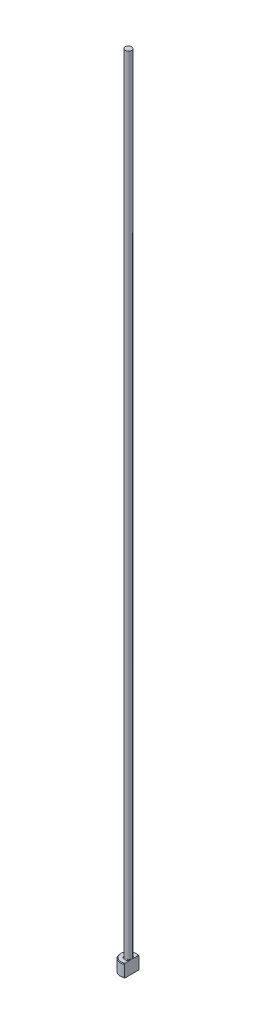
ISO-10303-21;
HEADER;
FILE_DESCRIPTION(('STEP AP214'),'2;1');
FILE_NAME('part.step','',(''),(''),'','','');
FILE_SCHEMA(('AUTOMOTIVE_DESIGN { 1 0 10303 214 1 1 1 1 }'));
ENDSEC;
DATA;
#1=APPLICATION_CONTEXT('core data for automotive mechanical design processes');
#2=APPLICATION_PROTOCOL_DEFINITION('international standard','automotive_design',2000,#1);
#3=PRODUCT_CONTEXT('',#1,'mechanical');
#4=PRODUCT('Part','Part','',(#3));
#5=PRODUCT_RELATED_PRODUCT_CATEGORY('part','',(#4));
#6=PRODUCT_DEFINITION_FORMATION('','',#4);
#7=PRODUCT_DEFINITION_CONTEXT('part definition',#1,'design');
#8=PRODUCT_DEFINITION('design','',#6,#7);
#9=PRODUCT_DEFINITION_SHAPE('','',#8);
#10=(LENGTH_UNIT() NAMED_UNIT(*) SI_UNIT(.MILLI.,.METRE.));
#11=(NAMED_UNIT(*) PLANE_ANGLE_UNIT() SI_UNIT($,.RADIAN.));
#12=(NAMED_UNIT(*) SI_UNIT($,.STERADIAN.) SOLID_ANGLE_UNIT());
#13=UNCERTAINTY_MEASURE_WITH_UNIT(LENGTH_MEASURE(1.E-05),#10,'distance_accuracy_value','');
#14=(GEOMETRIC_REPRESENTATION_CONTEXT(3) GLOBAL_UNCERTAINTY_ASSIGNED_CONTEXT((#13)) GLOBAL_UNIT_ASSIGNED_CONTEXT((#10,
#11,#12)) REPRESENTATION_CONTEXT('',''));
#15=CARTESIAN_POINT('',(0.,0.,0.));
#16=DIRECTION('',(0.,0.,1.));
#17=DIRECTION('',(1.,0.,0.));
#18=AXIS2_PLACEMENT_3D('',#15,#16,#17);
#19=CARTESIAN_POINT('',(0.,0.,0.));
#20=DIRECTION('',(0.,-1.,0.));
#21=DIRECTION('',(0.,0.,-1.));
#22=AXIS2_PLACEMENT_3D('',#19,#20,#21);
#23=PLANE('',#22);
#24=CARTESIAN_POINT('',(0.,0.,0.));
#25=DIRECTION('',(0.,-1.,0.));
#26=DIRECTION('',(0.,0.,-1.));
#27=AXIS2_PLACEMENT_3D('',#24,#25,#26);
#28=CIRCLE('',#27,2.3);
#29=CARTESIAN_POINT('',(0.999999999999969,0.,2.07123151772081));
#30=VERTEX_POINT('',#29);
#31=CARTESIAN_POINT('',(0.999999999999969,0.,-2.07123151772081));
#32=VERTEX_POINT('',#31);
#33=EDGE_CURVE('E98',#30,#32,#28,.T.);
#34=ORIENTED_EDGE('',*,*,#33,.T.);
#35=DIRECTION('',(0.,0.,1.));
#36=VECTOR('',#35,1.);
#37=CARTESIAN_POINT('',(0.999999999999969,0.,2.2912878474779));
#38=LINE('',#37,#36);
#39=EDGE_CURVE('E83',#32,#30,#38,.T.);
#40=ORIENTED_EDGE('',*,*,#39,.T.);
#41=EDGE_LOOP('',(#34,#40));
#42=FACE_BOUND('',#41,.T.);
#43=ADVANCED_FACE('F32',(#42),#23,.T.);
#44=CARTESIAN_POINT('',(0.,259.958771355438,0.));
#45=DIRECTION('',(0.,1.,0.));
#46=DIRECTION('',(0.,0.,1.));
#47=AXIS2_PLACEMENT_3D('',#44,#45,#46);
#48=CYLINDRICAL_SURFACE('',#47,2.49999999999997);
#49=CARTESIAN_POINT('',(0.,3.79999999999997,0.));
#50=DIRECTION('',(0.,1.,0.));
#51=DIRECTION('',(0.,0.,1.));
#52=AXIS2_PLACEMENT_3D('',#49,#50,#51);
#53=CIRCLE('',#52,2.49999999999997);
#54=CARTESIAN_POINT('',(0.999999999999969,3.79999999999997,2.2912878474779));
#55=VERTEX_POINT('',#54);
#56=CARTESIAN_POINT('',(0.999999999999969,3.79999999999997,-2.2912878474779));
#57=VERTEX_POINT('',#56);
#58=EDGE_CURVE('E104',#55,#57,#53,.F.);
#59=ORIENTED_EDGE('',*,*,#58,.T.);
#60=DIRECTION('',(0.,-1.,0.));
#61=VECTOR('',#60,1.);
#62=CARTESIAN_POINT('',(0.999999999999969,250.,-2.2912878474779));
#63=LINE('',#62,#61);
#64=CARTESIAN_POINT('',(0.999999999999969,0.199999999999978,-2.2912878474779));
#65=VERTEX_POINT('',#64);
#66=EDGE_CURVE('E183',#57,#65,#63,.T.);
#67=ORIENTED_EDGE('',*,*,#66,.T.);
#68=CARTESIAN_POINT('',(0.,0.199999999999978,0.));
#69=DIRECTION('',(0.,-1.,0.));
#70=DIRECTION('',(0.,0.,-1.));
#71=AXIS2_PLACEMENT_3D('',#68,#69,#70);
#72=CIRCLE('',#71,2.49999999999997);
#73=CARTESIAN_POINT('',(0.999999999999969,0.199999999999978,2.2912878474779));
#74=VERTEX_POINT('',#73);
#75=EDGE_CURVE('E100',#65,#74,#72,.F.);
#76=ORIENTED_EDGE('',*,*,#75,.T.);
#77=DIRECTION('',(0.,-1.,0.));
#78=VECTOR('',#77,1.);
#79=CARTESIAN_POINT('',(0.999999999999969,250.,2.2912878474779));
#80=LINE('',#79,#78);
#81=EDGE_CURVE('E93',#55,#74,#80,.T.);
#82=ORIENTED_EDGE('',*,*,#81,.F.);
#83=EDGE_LOOP('',(#59,#67,#76,#82));
#84=FACE_BOUND('',#83,.T.);
#85=ADVANCED_FACE('F158',(#84),#48,.T.);
#86=CARTESIAN_POINT('',(-2.49999999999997,4.,0.));
#87=DIRECTION('',(0.,1.,0.));
#88=DIRECTION('',(0.,0.,1.));
#89=AXIS2_PLACEMENT_3D('',#86,#87,#88);
#90=PLANE('',#89);
#91=CARTESIAN_POINT('',(0.,4.,0.));
#92=DIRECTION('',(0.,1.,0.));
#93=DIRECTION('',(0.,0.,1.));
#94=AXIS2_PLACEMENT_3D('',#91,#92,#93);
#95=CIRCLE('',#94,2.29999999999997);
#96=CARTESIAN_POINT('',(0.999999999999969,4.,-2.07123151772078));
#97=VERTEX_POINT('',#96);
#98=CARTESIAN_POINT('',(0.999999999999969,4.,2.07123151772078));
#99=VERTEX_POINT('',#98);
#100=EDGE_CURVE('E178',#97,#99,#95,.T.);
#101=ORIENTED_EDGE('',*,*,#100,.T.);
#102=DIRECTION('',(0.,0.,-1.));
#103=VECTOR('',#102,1.);
#104=CARTESIAN_POINT('',(0.999999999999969,4.,0.));
#105=LINE('',#104,#103);
#106=CARTESIAN_POINT('',(0.999999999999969,3.99999999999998,0.663324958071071));
#107=VERTEX_POINT('',#106);
#108=EDGE_CURVE('E57',#99,#107,#105,.T.);
#109=ORIENTED_EDGE('',*,*,#108,.T.);
#110=CARTESIAN_POINT('',(0.,4.,0.));
#111=DIRECTION('',(0.,1.,0.));
#112=DIRECTION('',(0.,0.,1.));
#113=AXIS2_PLACEMENT_3D('',#110,#111,#112);
#114=CIRCLE('',#113,1.19999999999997);
#115=CARTESIAN_POINT('',(0.999999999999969,3.99999999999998,-0.663324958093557));
#116=VERTEX_POINT('',#115);
#117=EDGE_CURVE('E107',#107,#116,#114,.F.);
#118=ORIENTED_EDGE('',*,*,#117,.T.);
#119=EDGE_CURVE('E136',#116,#97,#105,.T.);
#120=ORIENTED_EDGE('',*,*,#119,.T.);
#121=EDGE_LOOP('',(#101,#109,#118,#120));
#122=FACE_BOUND('',#121,.T.);
#123=ADVANCED_FACE('F147',(#122),#90,.T.);
#124=CARTESIAN_POINT('',(0.,4.,0.));
#125=DIRECTION('',(0.,-1.,0.));
#126=DIRECTION('',(0.,0.,-1.));
#127=AXIS2_PLACEMENT_3D('',#124,#125,#126);
#128=CONICAL_SURFACE('',#127,2.29999999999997,0.785398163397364);
#129=ORIENTED_EDGE('',*,*,#58,.F.);
#130=CARTESIAN_POINT('',(0.999999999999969,1.15817039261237,5.043650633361));
#131=CARTESIAN_POINT('',(0.999999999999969,1.28171614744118,4.91769392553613));
#132=CARTESIAN_POINT('',(0.999999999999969,1.40517853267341,4.79165523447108));
#133=CARTESIAN_POINT('',(0.999999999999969,1.65205736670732,4.53917252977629));
#134=CARTESIAN_POINT('',(0.999999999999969,1.77547348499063,4.41272819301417));
#135=CARTESIAN_POINT('',(0.999999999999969,2.02507999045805,4.15641759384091));
#136=CARTESIAN_POINT('',(0.999999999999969,2.15126317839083,4.02654431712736));
#137=CARTESIAN_POINT('',(0.999999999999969,2.40304621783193,3.76660249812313));
#138=CARTESIAN_POINT('',(0.999999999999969,2.52864665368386,3.63653452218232));
#139=CARTESIAN_POINT('',(0.999999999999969,2.76776970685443,3.38787610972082));
#140=CARTESIAN_POINT('',(0.999999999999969,2.88133977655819,3.26933134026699));
#141=CARTESIAN_POINT('',(0.999999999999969,3.10787167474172,3.03166264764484));
#142=CARTESIAN_POINT('',(0.999999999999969,3.22083350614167,2.91253872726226));
#143=CARTESIAN_POINT('',(0.999999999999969,3.44656995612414,2.67277252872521));
#144=CARTESIAN_POINT('',(0.999999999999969,3.55933947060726,2.55212543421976));
#145=CARTESIAN_POINT('',(0.999999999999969,3.78351625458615,2.30972256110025));
#146=CARTESIAN_POINT('',(0.999999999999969,3.89492439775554,2.18796759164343));
#147=CARTESIAN_POINT('',(0.999999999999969,4.11318730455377,1.94548589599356));
#148=CARTESIAN_POINT('',(0.999999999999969,4.22008776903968,1.82480064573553));
#149=CARTESIAN_POINT('',(0.999999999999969,4.37813361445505,1.64149718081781));
#150=CARTESIAN_POINT('',(0.999999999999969,4.43049954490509,1.57993333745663));
#151=CARTESIAN_POINT('',(0.999999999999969,4.53410631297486,1.45586813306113));
#152=CARTESIAN_POINT('',(0.999999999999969,4.58534721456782,1.39336682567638));
#153=CARTESIAN_POINT('',(0.999999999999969,4.68568582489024,1.2678398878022));
#154=CARTESIAN_POINT('',(0.999999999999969,4.73480144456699,1.20482863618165));
#155=CARTESIAN_POINT('',(0.999999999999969,4.83086890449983,1.07709082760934));
#156=CARTESIAN_POINT('',(0.999999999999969,4.87781921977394,1.0123631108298));
#157=CARTESIAN_POINT('',(0.999999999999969,4.96818560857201,0.880911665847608));
#158=CARTESIAN_POINT('',(0.999999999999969,5.01161706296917,0.814198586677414));
#159=CARTESIAN_POINT('',(0.999999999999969,5.09325231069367,0.677671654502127));
#160=CARTESIAN_POINT('',(0.999999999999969,5.13146487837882,0.607863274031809));
#161=CARTESIAN_POINT('',(0.999999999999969,5.17260892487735,0.520757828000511));
#162=CARTESIAN_POINT('',(0.999999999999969,5.17963219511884,0.505387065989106));
#163=CARTESIAN_POINT('',(0.999999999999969,5.19324475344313,0.474448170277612));
#164=CARTESIAN_POINT('',(0.999999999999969,5.19983388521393,0.458879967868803));
#165=CARTESIAN_POINT('',(0.999999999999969,5.21887613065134,0.411884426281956));
#166=CARTESIAN_POINT('',(0.999999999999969,5.23060772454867,0.380158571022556));
#167=CARTESIAN_POINT('',(0.999999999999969,5.25156131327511,0.316410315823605));
#168=CARTESIAN_POINT('',(0.999999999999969,5.26081845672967,0.284399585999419));
#169=CARTESIAN_POINT('',(0.999999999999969,5.27663134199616,0.219696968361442));
#170=CARTESIAN_POINT('',(0.999999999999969,5.28318629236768,0.187004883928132));
#171=CARTESIAN_POINT('',(0.999999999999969,5.29332210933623,0.120434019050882));
#172=CARTESIAN_POINT('',(0.999999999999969,5.29683603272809,0.0865448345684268));
#173=CARTESIAN_POINT('',(0.999999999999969,5.30040235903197,0.0185934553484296));
#174=CARTESIAN_POINT('',(0.999999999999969,5.30045600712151,-0.0154686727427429));
#175=CARTESIAN_POINT('',(0.999999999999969,5.29709918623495,-0.0834515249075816));
#176=CARTESIAN_POINT('',(0.999999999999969,5.29368537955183,-0.117372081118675));
#177=CARTESIAN_POINT('',(0.999999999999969,5.2836261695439,-0.184734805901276));
#178=CARTESIAN_POINT('',(0.999999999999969,5.27697933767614,-0.218176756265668));
#179=CARTESIAN_POINT('',(0.999999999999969,5.25861838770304,-0.293522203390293));
#180=CARTESIAN_POINT('',(0.999999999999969,5.24601100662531,-0.335206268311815));
#181=CARTESIAN_POINT('',(0.999999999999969,5.21711806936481,-0.417267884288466));
#182=CARTESIAN_POINT('',(0.999999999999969,5.20083078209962,-0.457644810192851));
#183=CARTESIAN_POINT('',(0.999999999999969,5.16531625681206,-0.53739243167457));
#184=CARTESIAN_POINT('',(0.999999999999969,5.1460699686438,-0.576754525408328));
#185=CARTESIAN_POINT('',(0.999999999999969,5.10541239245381,-0.654316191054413));
#186=CARTESIAN_POINT('',(0.999999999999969,5.08400173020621,-0.692516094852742));
#187=CARTESIAN_POINT('',(0.999999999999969,5.03811272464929,-0.770330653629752));
#188=CARTESIAN_POINT('',(0.999999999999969,5.01352589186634,-0.809880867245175));
#189=CARTESIAN_POINT('',(0.999999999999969,4.96292539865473,-0.888061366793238));
#190=CARTESIAN_POINT('',(0.999999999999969,4.93691146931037,-0.926691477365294));
#191=CARTESIAN_POINT('',(0.999999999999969,4.8572001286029,-1.04150369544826));
#192=CARTESIAN_POINT('',(0.999999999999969,4.80186935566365,-1.11654866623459));
#193=CARTESIAN_POINT('',(0.999999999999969,4.688383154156,-1.26473866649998));
#194=CARTESIAN_POINT('',(0.999999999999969,4.63022092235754,-1.33787839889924));
#195=CARTESIAN_POINT('',(0.999999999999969,4.51208910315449,-1.48269245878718));
#196=CARTESIAN_POINT('',(0.999999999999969,4.45211930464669,-1.55436661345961));
#197=CARTESIAN_POINT('',(0.999999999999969,4.33067987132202,-1.69694421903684));
#198=CARTESIAN_POINT('',(0.999999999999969,4.26920502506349,-1.76784320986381));
#199=CARTESIAN_POINT('',(0.999999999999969,4.14533845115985,-1.90884637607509));
#200=CARTESIAN_POINT('',(0.999999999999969,4.08294663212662,-1.97895047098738));
#201=CARTESIAN_POINT('',(0.999999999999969,3.89498664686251,-2.18811918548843));
#202=CARTESIAN_POINT('',(0.999999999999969,3.76842113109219,-2.32628638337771));
#203=CARTESIAN_POINT('',(0.999999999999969,3.53875468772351,-2.57413295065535));
#204=CARTESIAN_POINT('',(0.999999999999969,3.43593273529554,-2.68407249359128));
#205=CARTESIAN_POINT('',(0.999999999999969,3.22955977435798,-2.90326847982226));
#206=CARTESIAN_POINT('',(0.999999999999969,3.12600875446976,-3.01252491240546));
#207=CARTESIAN_POINT('',(0.999999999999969,2.81444279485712,-3.33969806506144));
#208=CARTESIAN_POINT('',(0.999999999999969,2.60565048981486,-3.55687358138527));
#209=CARTESIAN_POINT('',(0.999999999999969,2.1907241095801,-3.98610808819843));
#210=CARTESIAN_POINT('',(0.999999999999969,1.98461149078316,-4.19818787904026));
#211=CARTESIAN_POINT('',(0.999999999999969,1.6749669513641,-4.51569174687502));
#212=CARTESIAN_POINT('',(0.999999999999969,1.57171087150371,-4.62138500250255));
#213=CARTESIAN_POINT('',(0.999999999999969,1.36504682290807,-4.83262218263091));
#214=CARTESIAN_POINT('',(0.999999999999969,1.26163885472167,-4.93816610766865));
#215=CARTESIAN_POINT('',(0.999999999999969,1.15817039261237,-5.043650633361));
#216=B_SPLINE_CURVE_WITH_KNOTS('',3,(#130,#131,#132,#133,#134,#135,#136,#137,#138,#139,#140,
#141,#142,#143,#144,#145,#146,#147,#148,#149,#150,#151,#152,#153,#154,#155,#156,#157,#158,#159,
#160,#161,#162,#163,#164,#165,#166,#167,#168,#169,#170,#171,#172,#173,#174,#175,#176,#177,#178,
#179,#180,#181,#182,#183,#184,#185,#186,#187,#188,#189,#190,#191,#192,#193,#194,#195,#196,#197,
#198,#199,#200,#201,#202,#203,#204,#205,#206,#207,#208,#209,#210,#211,#212,#213,#214,#215),
.UNSPECIFIED.,.F.,.F.,(4,2,2,2,2,2,2,2,2,2,2,2,2,2,2,2,2,2,2,2,2,2,2,2,2,2,2,2,2,2,2,2,2,2,2,2,
2,2,2,2,2,2,4),(0.,0.529299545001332,1.05937223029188,1.60260578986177,2.14504205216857,
2.63754347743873,3.13004253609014,3.62546908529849,4.12055895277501,4.60418442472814,
4.846643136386,5.08908802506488,5.32873451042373,5.56854727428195,5.80724786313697,
6.04554205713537,6.09623410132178,6.14694429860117,6.24833951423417,6.34820702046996,
6.44810375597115,6.5501473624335,6.65215424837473,6.75425941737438,6.85640974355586,
6.98682841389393,7.11730856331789,7.24866693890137,7.37998744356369,7.51965621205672,
7.65935139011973,7.93894909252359,8.21925538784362,8.49959454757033,8.7811027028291,
9.06263910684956,9.62473592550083,10.0763211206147,10.5279133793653,11.431693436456,
12.3189018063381,12.7621802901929,13.2054571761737),.UNSPECIFIED.);
#217=EDGE_CURVE('E135',#55,#99,#216,.T.);
#218=ORIENTED_EDGE('',*,*,#217,.T.);
#219=ORIENTED_EDGE('',*,*,#100,.F.);
#220=EDGE_CURVE('E127',#97,#57,#216,.T.);
#221=ORIENTED_EDGE('',*,*,#220,.T.);
#222=EDGE_LOOP('',(#129,#218,#219,#221));
#223=FACE_BOUND('',#222,.T.);
#224=ADVANCED_FACE('F143',(#223),#128,.T.);
#225=CARTESIAN_POINT('',(0.,0.199999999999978,0.));
#226=DIRECTION('',(0.,1.,0.));
#227=DIRECTION('',(0.,0.,1.));
#228=AXIS2_PLACEMENT_3D('',#225,#226,#227);
#229=CONICAL_SURFACE('',#228,2.49999999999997,0.785398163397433);
#230=ORIENTED_EDGE('',*,*,#75,.F.);
#231=CARTESIAN_POINT('',(0.999999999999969,2.84182960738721,-5.043650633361));
#232=CARTESIAN_POINT('',(0.999999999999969,2.71828385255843,-4.91769392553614));
#233=CARTESIAN_POINT('',(0.999999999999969,2.59482146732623,-4.79165523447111));
#234=CARTESIAN_POINT('',(0.999999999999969,2.34794263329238,-4.53917252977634));
#235=CARTESIAN_POINT('',(0.999999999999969,2.2245265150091,-4.41272819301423));
#236=CARTESIAN_POINT('',(0.999999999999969,1.97492000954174,-4.156417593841));
#237=CARTESIAN_POINT('',(0.999999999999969,1.84873682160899,-4.02654431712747));
#238=CARTESIAN_POINT('',(0.999999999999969,1.59695378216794,-3.76660249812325));
#239=CARTESIAN_POINT('',(0.999999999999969,1.47135334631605,-3.63653452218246));
#240=CARTESIAN_POINT('',(0.999999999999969,1.23223029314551,-3.38787610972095));
#241=CARTESIAN_POINT('',(0.999999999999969,1.11866022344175,-3.26933134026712));
#242=CARTESIAN_POINT('',(0.999999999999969,0.89212832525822,-3.03166264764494));
#243=CARTESIAN_POINT('',(0.999999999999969,0.779166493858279,-2.91253872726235));
#244=CARTESIAN_POINT('',(0.999999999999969,0.553430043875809,-2.67277252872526));
#245=CARTESIAN_POINT('',(0.999999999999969,0.440660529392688,-2.5521254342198));
#246=CARTESIAN_POINT('',(0.999999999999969,0.216483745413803,-2.30972256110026));
#247=CARTESIAN_POINT('',(0.999999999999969,0.105075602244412,-2.18796759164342));
#248=CARTESIAN_POINT('',(0.999999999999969,-0.113187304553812,-1.94548589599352));
#249=CARTESIAN_POINT('',(0.999999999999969,-0.220087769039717,-1.82480064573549));
#250=CARTESIAN_POINT('',(0.999999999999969,-0.378133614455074,-1.64149718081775));
#251=CARTESIAN_POINT('',(0.999999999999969,-0.430499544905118,-1.57993333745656));
#252=CARTESIAN_POINT('',(0.999999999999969,-0.534106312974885,-1.45586813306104));
#253=CARTESIAN_POINT('',(0.999999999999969,-0.585347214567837,-1.39336682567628));
#254=CARTESIAN_POINT('',(0.999999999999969,-0.685685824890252,-1.26783988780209));
#255=CARTESIAN_POINT('',(0.999999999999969,-0.734801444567,-1.20482863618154));
#256=CARTESIAN_POINT('',(0.999999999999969,-0.830868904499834,-1.07709082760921));
#257=CARTESIAN_POINT('',(0.999999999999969,-0.877819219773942,-1.01236311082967));
#258=CARTESIAN_POINT('',(0.999999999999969,-0.968185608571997,-0.88091166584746));
#259=CARTESIAN_POINT('',(0.999999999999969,-1.01161706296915,-0.814198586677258));
#260=CARTESIAN_POINT('',(0.999999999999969,-1.09325231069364,-0.677671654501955));
#261=CARTESIAN_POINT('',(0.999999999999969,-1.13146487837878,-0.60786327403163));
#262=CARTESIAN_POINT('',(0.999999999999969,-1.1726089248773,-0.520757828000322));
#263=CARTESIAN_POINT('',(0.999999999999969,-1.17963219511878,-0.505387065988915));
#264=CARTESIAN_POINT('',(0.999999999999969,-1.19324475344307,-0.474448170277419));
#265=CARTESIAN_POINT('',(0.999999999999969,-1.19983388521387,-0.458879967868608));
#266=CARTESIAN_POINT('',(0.999999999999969,-1.21887613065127,-0.411884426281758));
#267=CARTESIAN_POINT('',(0.999999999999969,-1.2306077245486,-0.380158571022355));
#268=CARTESIAN_POINT('',(0.999999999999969,-1.25156131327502,-0.3164103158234));
#269=CARTESIAN_POINT('',(0.999999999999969,-1.26081845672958,-0.284399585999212));
#270=CARTESIAN_POINT('',(0.999999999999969,-1.27663134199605,-0.219696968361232));
#271=CARTESIAN_POINT('',(0.999999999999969,-1.28318629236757,-0.18700488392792));
#272=CARTESIAN_POINT('',(0.999999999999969,-1.2933221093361,-0.120434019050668));
#273=CARTESIAN_POINT('',(0.999999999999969,-1.29683603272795,-0.0865448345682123));
#274=CARTESIAN_POINT('',(0.999999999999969,-1.30040235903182,-0.0185934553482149));
#275=CARTESIAN_POINT('',(0.999999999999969,-1.30045600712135,0.0154686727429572));
#276=CARTESIAN_POINT('',(0.999999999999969,-1.29709918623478,0.0834515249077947));
#277=CARTESIAN_POINT('',(0.999999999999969,-1.29368537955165,0.117372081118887));
#278=CARTESIAN_POINT('',(0.999999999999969,-1.28362616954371,0.184734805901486));
#279=CARTESIAN_POINT('',(0.999999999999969,-1.27697933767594,0.218176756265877));
#280=CARTESIAN_POINT('',(0.999999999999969,-1.25861838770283,0.29352220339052));
#281=CARTESIAN_POINT('',(0.999999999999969,-1.24601100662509,0.335206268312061));
#282=CARTESIAN_POINT('',(0.999999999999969,-1.21711806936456,0.417267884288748));
#283=CARTESIAN_POINT('',(0.999999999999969,-1.20083078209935,0.457644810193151));
#284=CARTESIAN_POINT('',(0.999999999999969,-1.16531625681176,0.537392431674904));
#285=CARTESIAN_POINT('',(0.999999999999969,-1.14606996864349,0.57675452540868));
#286=CARTESIAN_POINT('',(0.999999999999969,-1.10541239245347,0.654316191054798));
#287=CARTESIAN_POINT('',(0.999999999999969,-1.08400173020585,0.692516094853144));
#288=CARTESIAN_POINT('',(0.999999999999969,-1.03811272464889,0.770330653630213));
#289=CARTESIAN_POINT('',(0.999999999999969,-1.01352589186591,0.809880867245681));
#290=CARTESIAN_POINT('',(0.999999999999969,-0.96292539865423,0.88806136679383));
#291=CARTESIAN_POINT('',(0.999999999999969,-0.936911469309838,0.926691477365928));
#292=CARTESIAN_POINT('',(0.999999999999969,-0.857200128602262,1.04150369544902));
#293=CARTESIAN_POINT('',(0.999999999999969,-0.801869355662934,1.11654866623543));
#294=CARTESIAN_POINT('',(0.999999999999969,-0.688383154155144,1.26473866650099));
#295=CARTESIAN_POINT('',(0.999999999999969,-0.630220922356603,1.33787839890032));
#296=CARTESIAN_POINT('',(0.999999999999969,-0.512089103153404,1.48269245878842));
#297=CARTESIAN_POINT('',(0.999999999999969,-0.45211930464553,1.55436661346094));
#298=CARTESIAN_POINT('',(0.999999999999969,-0.330679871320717,1.69694421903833));
#299=CARTESIAN_POINT('',(0.999999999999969,-0.26920502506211,1.76784320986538));
#300=CARTESIAN_POINT('',(0.999999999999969,-0.14533845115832,1.90884637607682));
#301=CARTESIAN_POINT('',(0.999999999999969,-0.0829466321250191,1.97895047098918));
#302=CARTESIAN_POINT('',(0.999999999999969,0.105013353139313,2.18811918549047));
#303=CARTESIAN_POINT('',(0.999999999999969,0.231578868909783,2.32628638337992));
#304=CARTESIAN_POINT('',(0.999999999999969,0.461245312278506,2.57413295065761));
#305=CARTESIAN_POINT('',(0.999999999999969,0.564067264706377,2.68407249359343));
#306=CARTESIAN_POINT('',(0.999999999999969,0.770440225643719,2.9032684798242));
#307=CARTESIAN_POINT('',(0.999999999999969,0.873991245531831,3.01252491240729));
#308=CARTESIAN_POINT('',(0.999999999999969,1.18555720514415,3.33969806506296));
#309=CARTESIAN_POINT('',(0.999999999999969,1.39434951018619,3.55687358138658));
#310=CARTESIAN_POINT('',(0.999999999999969,1.80927589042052,3.98610808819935));
#311=CARTESIAN_POINT('',(0.999999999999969,2.01538850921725,4.19818787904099));
#312=CARTESIAN_POINT('',(0.999999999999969,2.325033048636,4.51569174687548));
#313=CARTESIAN_POINT('',(0.999999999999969,2.42828912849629,4.62138500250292));
#314=CARTESIAN_POINT('',(0.999999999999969,2.63495317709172,4.83262218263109));
#315=CARTESIAN_POINT('',(0.999999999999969,2.73836114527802,4.93816610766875));
#316=CARTESIAN_POINT('',(0.999999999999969,2.84182960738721,5.043650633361));
#317=B_SPLINE_CURVE_WITH_KNOTS('',3,(#231,#232,#233,#234,#235,#236,#237,#238,#239,#240,#241,
#242,#243,#244,#245,#246,#247,#248,#249,#250,#251,#252,#253,#254,#255,#256,#257,#258,#259,#260,
#261,#262,#263,#264,#265,#266,#267,#268,#269,#270,#271,#272,#273,#274,#275,#276,#277,#278,#279,
#280,#281,#282,#283,#284,#285,#286,#287,#288,#289,#290,#291,#292,#293,#294,#295,#296,#297,#298,
#299,#300,#301,#302,#303,#304,#305,#306,#307,#308,#309,#310,#311,#312,#313,#314,#315,#316),
.UNSPECIFIED.,.F.,.F.,(4,2,2,2,2,2,2,2,2,2,2,2,2,2,2,2,2,2,2,2,2,2,2,2,2,2,2,2,2,2,2,2,2,2,2,2,
2,2,2,2,2,2,4),(0.,0.529299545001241,1.0593722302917,1.6026057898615,2.14504205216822,
2.6375434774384,3.13004253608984,3.62546908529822,4.12055895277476,4.60418442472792,
4.84664313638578,5.08908802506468,5.32873451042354,5.56854727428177,5.8072478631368,
6.0455420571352,6.09623410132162,6.14694429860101,6.24833951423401,6.3482070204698,
6.44810375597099,6.55014736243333,6.65215424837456,6.75425941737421,6.8564097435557,
6.98682841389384,7.11730856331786,7.2486669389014,7.37998744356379,7.51965621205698,
7.65935139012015,7.93894909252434,8.21925538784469,8.49959454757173,8.78110270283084,
9.06263910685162,9.62473592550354,10.0763211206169,10.5279133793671,11.431693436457,
12.3189018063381,12.7621802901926,13.2054571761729),.UNSPECIFIED.);
#318=EDGE_CURVE('E86',#65,#32,#317,.T.);
#319=ORIENTED_EDGE('',*,*,#318,.T.);
#320=ORIENTED_EDGE('',*,*,#33,.F.);
#321=EDGE_CURVE('E89',#30,#74,#317,.T.);
#322=ORIENTED_EDGE('',*,*,#321,.T.);
#323=EDGE_LOOP('',(#230,#319,#320,#322));
#324=FACE_BOUND('',#323,.T.);
#325=ADVANCED_FACE('F97',(#324),#229,.T.);
#326=CARTESIAN_POINT('',(0.,4.19999999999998,0.));
#327=DIRECTION('',(0.,1.,0.));
#328=DIRECTION('',(0.,0.,1.));
#329=AXIS2_PLACEMENT_3D('',#326,#327,#328);
#330=TOROIDAL_SURFACE('',#329,1.19999999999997,0.2);
#331=CARTESIAN_POINT('',(0.999999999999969,4.19999999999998,0.));
#332=CARTESIAN_POINT('',(0.999999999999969,4.20000051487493,2.59065974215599E-12));
#333=CARTESIAN_POINT('',(0.999999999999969,4.20000102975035,-9.42496361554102E-08));
#334=CARTESIAN_POINT('',(0.999999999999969,4.20000202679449,-4.00799852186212E-07));
#335=CARTESIAN_POINT('',(0.999999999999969,4.20000250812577,-6.15372282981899E-07));
#336=CARTESIAN_POINT('',(0.999999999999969,4.20000346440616,-1.13351403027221E-06));
#337=CARTESIAN_POINT('',(0.999999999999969,4.20000393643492,-1.44235226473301E-06));
#338=CARTESIAN_POINT('',(0.999999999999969,4.20000483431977,-2.11388878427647E-06));
#339=CARTESIAN_POINT('',(0.999999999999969,4.20000526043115,-2.47625954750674E-06));
#340=CARTESIAN_POINT('',(0.999999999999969,4.20000666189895,-3.75794161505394E-06));
#341=CARTESIAN_POINT('',(0.999999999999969,4.2000075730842,-4.74818961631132E-06));
#342=CARTESIAN_POINT('',(0.999999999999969,4.20000922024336,-6.81289838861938E-06));
#343=CARTESIAN_POINT('',(0.999999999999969,4.20000996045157,-7.8841765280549E-06));
#344=CARTESIAN_POINT('',(0.999999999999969,4.20001267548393,-1.19907295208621E-05));
#345=CARTESIAN_POINT('',(0.999999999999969,4.20001450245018,-1.51274185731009E-05));
#346=CARTESIAN_POINT('',(0.999999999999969,4.20001755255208,-2.13715427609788E-05));
#347=CARTESIAN_POINT('',(0.999999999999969,4.20001881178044,-2.44620178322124E-05));
#348=CARTESIAN_POINT('',(0.999999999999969,4.20002404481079,-3.74145212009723E-05));
#349=CARTESIAN_POINT('',(0.999999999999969,4.20002793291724,-4.73052128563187E-05));
#350=CARTESIAN_POINT('',(0.999999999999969,4.2000342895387,-6.59457080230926E-05));
#351=CARTESIAN_POINT('',(0.999999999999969,4.20003688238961,-7.46515304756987E-05));
#352=CARTESIAN_POINT('',(0.999999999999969,4.20005709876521,-0.000137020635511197));
#353=CARTESIAN_POINT('',(0.999999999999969,4.20008244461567,-0.000187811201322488));
#354=CARTESIAN_POINT('',(0.999999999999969,4.20017671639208,-0.000384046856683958));
#355=CARTESIAN_POINT('',(0.999999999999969,4.2002399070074,-0.000531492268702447));
#356=CARTESIAN_POINT('',(0.999999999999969,4.20048701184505,-0.00109942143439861));
#357=CARTESIAN_POINT('',(0.999999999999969,4.20067693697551,-0.00151784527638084));
#358=CARTESIAN_POINT('',(0.999999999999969,4.20144296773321,-0.00321386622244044));
#359=CARTESIAN_POINT('',(0.999999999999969,4.20201230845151,-0.00449374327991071));
#360=CARTESIAN_POINT('',(0.999999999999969,4.20998444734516,-0.0224047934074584));
#361=CARTESIAN_POINT('',(0.999999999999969,4.2174352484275,-0.039020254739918));
#362=CARTESIAN_POINT('',(0.999999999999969,4.23197002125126,-0.0717084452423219));
#363=CARTESIAN_POINT('',(0.999999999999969,4.23905766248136,-0.0877796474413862));
#364=CARTESIAN_POINT('',(0.999999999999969,4.25389009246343,-0.121781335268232));
#365=CARTESIAN_POINT('',(0.999999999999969,4.26161964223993,-0.139718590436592));
#366=CARTESIAN_POINT('',(0.999999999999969,4.27689168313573,-0.175878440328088));
#367=CARTESIAN_POINT('',(0.999999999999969,4.28443162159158,-0.19410211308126));
#368=CARTESIAN_POINT('',(0.999999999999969,4.30282726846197,-0.239840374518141));
#369=CARTESIAN_POINT('',(0.999999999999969,4.31345710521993,-0.267447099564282));
#370=CARTESIAN_POINT('',(0.999999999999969,4.33331094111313,-0.322481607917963));
#371=CARTESIAN_POINT('',(0.999999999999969,4.34256072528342,-0.349899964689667));
#372=CARTESIAN_POINT('',(0.999999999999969,4.35732089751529,-0.398044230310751));
#373=CARTESIAN_POINT('',(0.999999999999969,4.36317895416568,-0.418661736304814));
#374=CARTESIAN_POINT('',(0.999999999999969,4.37387907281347,-0.460275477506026));
#375=CARTESIAN_POINT('',(0.999999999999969,4.37871519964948,-0.48127319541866));
#376=CARTESIAN_POINT('',(0.999999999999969,4.39174175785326,-0.546853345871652));
#377=CARTESIAN_POINT('',(0.999999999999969,4.39776253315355,-0.591947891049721));
#378=CARTESIAN_POINT('',(0.999999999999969,4.400401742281,-0.660990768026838));
#379=CARTESIAN_POINT('',(0.999999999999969,4.400126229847,-0.684818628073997));
#380=CARTESIAN_POINT('',(0.999999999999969,4.39660783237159,-0.732027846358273));
#381=CARTESIAN_POINT('',(0.999999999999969,4.39339826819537,-0.755411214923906));
#382=CARTESIAN_POINT('',(0.999999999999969,4.38447874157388,-0.796083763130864));
#383=CARTESIAN_POINT('',(0.999999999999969,4.37951676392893,-0.813533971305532));
#384=CARTESIAN_POINT('',(0.999999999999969,4.36698902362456,-0.847531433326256));
#385=CARTESIAN_POINT('',(0.999999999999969,4.35942232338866,-0.864078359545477));
#386=CARTESIAN_POINT('',(0.999999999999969,4.34431787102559,-0.890141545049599));
#387=CARTESIAN_POINT('',(0.999999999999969,4.33762931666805,-0.900148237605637));
#388=CARTESIAN_POINT('',(0.999999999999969,4.32281345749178,-0.919033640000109));
#389=CARTESIAN_POINT('',(0.999999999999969,4.3146887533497,-0.92791433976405));
#390=CARTESIAN_POINT('',(0.999999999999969,4.29878569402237,-0.942427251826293));
#391=CARTESIAN_POINT('',(0.999999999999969,4.29127620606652,-0.948352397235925));
#392=CARTESIAN_POINT('',(0.999999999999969,4.27538509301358,-0.958904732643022));
#393=CARTESIAN_POINT('',(0.999999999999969,4.26700378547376,-0.963532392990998));
#394=CARTESIAN_POINT('',(0.999999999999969,4.24944905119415,-0.971220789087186));
#395=CARTESIAN_POINT('',(0.999999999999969,4.24026913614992,-0.974266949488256));
#396=CARTESIAN_POINT('',(0.999999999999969,4.22148612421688,-0.978466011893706));
#397=CARTESIAN_POINT('',(0.999999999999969,4.21188346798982,-0.979620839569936));
#398=CARTESIAN_POINT('',(0.999999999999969,4.19406751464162,-0.979911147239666));
#399=CARTESIAN_POINT('',(0.999999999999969,4.18585759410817,-0.979318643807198));
#400=CARTESIAN_POINT('',(0.999999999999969,4.16966497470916,-0.976727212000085));
#401=CARTESIAN_POINT('',(0.999999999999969,4.16168225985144,-0.97472838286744));
#402=CARTESIAN_POINT('',(0.999999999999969,4.14632905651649,-0.969513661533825));
#403=CARTESIAN_POINT('',(0.999999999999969,4.13894889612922,-0.966325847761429));
#404=CARTESIAN_POINT('',(0.999999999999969,4.12474145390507,-0.958901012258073));
#405=CARTESIAN_POINT('',(0.999999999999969,4.11791436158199,-0.954663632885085));
#406=CARTESIAN_POINT('',(0.999999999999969,4.10210888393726,-0.943323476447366));
#407=CARTESIAN_POINT('',(0.999999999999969,4.09345388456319,-0.935769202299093));
#408=CARTESIAN_POINT('',(0.999999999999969,4.07747441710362,-0.9193596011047));
#409=CARTESIAN_POINT('',(0.999999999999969,4.07015330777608,-0.910501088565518));
#410=CARTESIAN_POINT('',(0.999999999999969,4.05394486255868,-0.887884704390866));
#411=CARTESIAN_POINT('',(0.999999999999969,4.04572469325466,-0.873650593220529));
#412=CARTESIAN_POINT('',(0.999999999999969,4.03162462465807,-0.844119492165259));
#413=CARTESIAN_POINT('',(0.999999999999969,4.02574383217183,-0.828822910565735));
#414=CARTESIAN_POINT('',(0.999999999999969,4.01314628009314,-0.788605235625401));
#415=CARTESIAN_POINT('',(0.999999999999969,4.00790637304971,-0.763225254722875));
#416=CARTESIAN_POINT('',(0.999999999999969,4.00123778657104,-0.711706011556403));
#417=CARTESIAN_POINT('',(0.999999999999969,3.99986086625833,-0.685561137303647));
#418=CARTESIAN_POINT('',(0.999999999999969,4.00029138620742,-0.610897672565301));
#419=CARTESIAN_POINT('',(0.999999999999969,4.00583944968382,-0.562408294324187));
#420=CARTESIAN_POINT('',(0.999999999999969,4.01894675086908,-0.492015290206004));
#421=CARTESIAN_POINT('',(0.999999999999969,4.02392178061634,-0.469516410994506));
#422=CARTESIAN_POINT('',(0.999999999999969,4.03507986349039,-0.424950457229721));
#423=CARTESIAN_POINT('',(0.999999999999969,4.04125559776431,-0.402881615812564));
#424=CARTESIAN_POINT('',(0.999999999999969,4.05640318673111,-0.353063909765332));
#425=CARTESIAN_POINT('',(0.999999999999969,4.06567810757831,-0.32540920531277));
#426=CARTESIAN_POINT('',(0.999999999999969,4.08561584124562,-0.269900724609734));
#427=CARTESIAN_POINT('',(0.999999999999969,4.09630536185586,-0.242056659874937));
#428=CARTESIAN_POINT('',(0.999999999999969,4.11482832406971,-0.195905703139));
#429=CARTESIAN_POINT('',(0.999999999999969,4.12243033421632,-0.177504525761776));
#430=CARTESIAN_POINT('',(0.999999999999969,4.13783353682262,-0.140994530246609));
#431=CARTESIAN_POINT('',(0.999999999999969,4.14563210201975,-0.122884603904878));
#432=CARTESIAN_POINT('',(0.999999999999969,4.16059970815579,-0.0885577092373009));
#433=CARTESIAN_POINT('',(0.999999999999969,4.16775305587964,-0.0723337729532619));
#434=CARTESIAN_POINT('',(0.999999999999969,4.18242403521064,-0.039335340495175));
#435=CARTESIAN_POINT('',(0.999999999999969,4.18994542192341,-0.0225624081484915));
#436=CARTESIAN_POINT('',(0.999999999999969,4.19798770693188,-0.00449370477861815));
#437=CARTESIAN_POINT('',(0.999999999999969,4.19855706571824,-0.00321379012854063));
#438=CARTESIAN_POINT('',(0.999999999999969,4.19932310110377,-0.00151776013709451));
#439=CARTESIAN_POINT('',(0.999999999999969,4.19951301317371,-0.00109936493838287));
#440=CARTESIAN_POINT('',(0.999999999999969,4.19976010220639,-0.000531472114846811));
#441=CARTESIAN_POINT('',(0.999999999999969,4.19982328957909,-0.000384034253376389));
#442=CARTESIAN_POINT('',(0.999999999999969,4.19991755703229,-0.00018780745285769));
#443=CARTESIAN_POINT('',(0.999999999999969,4.19994290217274,-0.000137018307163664));
#444=CARTESIAN_POINT('',(0.999999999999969,4.19996311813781,-7.46508468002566E-05));
#445=CARTESIAN_POINT('',(0.999999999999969,4.19996571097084,-6.59451384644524E-05));
#446=CARTESIAN_POINT('',(0.999999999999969,4.19997206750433,-4.73048902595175E-05));
#447=CARTESIAN_POINT('',(0.999999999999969,4.19997595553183,-3.74143283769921E-05));
#448=CARTESIAN_POINT('',(0.999999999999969,4.19998118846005,-2.44619708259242E-05));
#449=CARTESIAN_POINT('',(0.999999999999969,4.19998244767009,-2.13715143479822E-05));
#450=CARTESIAN_POINT('',(0.999999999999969,4.19998549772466,-1.51274244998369E-05));
#451=CARTESIAN_POINT('',(0.999999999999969,4.19998732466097,-1.19907505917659E-05));
#452=CARTESIAN_POINT('',(0.999999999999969,4.19999003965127,-7.88421144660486E-06));
#453=CARTESIAN_POINT('',(0.999999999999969,4.19999077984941,-6.81293476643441E-06));
#454=CARTESIAN_POINT('',(0.999999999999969,4.19999242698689,-4.74822687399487E-06));
#455=CARTESIAN_POINT('',(0.999999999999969,4.19999333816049,-3.75797821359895E-06));
#456=CARTESIAN_POINT('',(0.999999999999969,4.19999473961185,-2.47629279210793E-06));
#457=CARTESIAN_POINT('',(0.999999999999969,4.19999516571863,-2.11392057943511E-06));
#458=CARTESIAN_POINT('',(0.999999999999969,4.19999606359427,-1.44238034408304E-06));
#459=CARTESIAN_POINT('',(0.999999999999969,4.19999653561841,-1.13353983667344E-06));
#460=CARTESIAN_POINT('',(0.999999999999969,4.1999974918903,-6.15392582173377E-07));
#461=CARTESIAN_POINT('',(0.999999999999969,4.19999797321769,-4.0081700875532E-07));
#462=CARTESIAN_POINT('',(0.999999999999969,4.19999897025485,-9.42592138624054E-08));
#463=CARTESIAN_POINT('',(0.999999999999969,4.19999948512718,-2.59064895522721E-12));
#464=CARTESIAN_POINT('',(0.999999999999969,4.19999999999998,0.));
#465=B_SPLINE_CURVE_WITH_KNOTS('',3,(#331,#332,#333,#334,#335,#336,#337,#338,#339,#340,#341,
#342,#343,#344,#345,#346,#347,#348,#349,#350,#351,#352,#353,#354,#355,#356,#357,#358,#359,#360,
#361,#362,#363,#364,#365,#366,#367,#368,#369,#370,#371,#372,#373,#374,#375,#376,#377,#378,#379,
#380,#381,#382,#383,#384,#385,#386,#387,#388,#389,#390,#391,#392,#393,#394,#395,#396,#397,#398,
#399,#400,#401,#402,#403,#404,#405,#406,#407,#408,#409,#410,#411,#412,#413,#414,#415,#416,#417,
#418,#419,#420,#421,#422,#423,#424,#425,#426,#427,#428,#429,#430,#431,#432,#433,#434,#435,#436,
#437,#438,#439,#440,#441,#442,#443,#444,#445,#446,#447,#448,#449,#450,#451,#452,#453,#454,#455,
#456,#457,#458,#459,#460,#461,#462,#463,#464),.UNSPECIFIED.,.T.,.F.,(4,2,2,2,2,2,2,2,2,2,2,2,2,
2,2,2,2,2,2,2,2,2,2,2,2,2,2,2,2,2,2,2,2,2,2,2,2,2,2,2,2,2,2,2,2,2,2,2,2,2,2,2,2,2,2,2,2,2,2,2,2,
2,2,2,2,2,4),(0.,1.54318091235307E-06,3.11656704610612E-06,4.80252014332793E-06,
6.4785555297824E-06,1.04956561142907E-05,1.4398891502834E-05,2.52504393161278E-05,
3.52518424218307E-05,6.71249457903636E-05,9.43496749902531E-05,0.000263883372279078,
0.000745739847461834,0.00212351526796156,0.00632669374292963,0.0609485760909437,
0.11364394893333,0.172237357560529,0.23140101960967,0.320129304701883,0.40690543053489,
0.471177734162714,0.535813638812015,0.67161710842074,0.742973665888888,0.813529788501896,
0.867802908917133,0.922095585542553,0.958095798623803,0.994031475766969,1.02261929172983,
1.05119673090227,1.08003306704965,1.1088400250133,1.1334101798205,1.15797860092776,
1.18200020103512,1.20602999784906,1.24030227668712,1.27465969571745,1.32369575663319,
1.37271307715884,1.45002425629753,1.52836647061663,1.67385288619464,1.74297459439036,
1.81168748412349,1.89915940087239,1.98861529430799,2.04834216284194,2.10749314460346,
2.16068730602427,2.21582681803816,2.22003012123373,2.221407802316,2.22188963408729,
2.2220591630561,2.22208638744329,2.22211826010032,2.22212826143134,2.22213911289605,
2.22214301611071,2.22214703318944,2.22214870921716,2.22215039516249,2.22215196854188,
2.22215351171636),.UNSPECIFIED.);
#466=CARTESIAN_POINT('',(0.999999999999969,4.19999999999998,0.));
#467=VERTEX_POINT('',#466);
#468=EDGE_CURVE('E11',#116,#467,#465,.T.);
#469=ORIENTED_EDGE('',*,*,#468,.F.);
#470=ORIENTED_EDGE('',*,*,#117,.F.);
#471=CARTESIAN_POINT('',(0.999999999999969,4.19999999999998,0.));
#472=CARTESIAN_POINT('',(0.999999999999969,4.19999948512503,-2.59066338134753E-12));
#473=CARTESIAN_POINT('',(0.999999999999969,4.19999897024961,9.42496361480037E-08));
#474=CARTESIAN_POINT('',(0.999999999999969,4.19999797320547,4.00799852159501E-07));
#475=CARTESIAN_POINT('',(0.999999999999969,4.19999749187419,6.15372282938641E-07));
#476=CARTESIAN_POINT('',(0.999999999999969,4.1999965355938,1.13351403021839E-06));
#477=CARTESIAN_POINT('',(0.999999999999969,4.19999606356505,1.44235226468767E-06));
#478=CARTESIAN_POINT('',(0.999999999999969,4.19999516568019,2.1138887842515E-06));
#479=CARTESIAN_POINT('',(0.999999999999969,4.19999473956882,2.47625954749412E-06));
#480=CARTESIAN_POINT('',(0.999999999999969,4.19999333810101,3.75794161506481E-06));
#481=CARTESIAN_POINT('',(0.999999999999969,4.19999242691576,4.74818961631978E-06));
#482=CARTESIAN_POINT('',(0.999999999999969,4.1999907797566,6.8128983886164E-06));
#483=CARTESIAN_POINT('',(0.999999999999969,4.19999003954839,7.88417652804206E-06));
#484=CARTESIAN_POINT('',(0.999999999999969,4.19998732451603,1.19907295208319E-05));
#485=CARTESIAN_POINT('',(0.999999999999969,4.19998549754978,1.5127418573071E-05));
#486=CARTESIAN_POINT('',(0.999999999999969,4.19998244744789,2.13715427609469E-05));
#487=CARTESIAN_POINT('',(0.999999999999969,4.19998118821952,2.44620178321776E-05));
#488=CARTESIAN_POINT('',(0.999999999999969,4.19997595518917,3.74145212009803E-05));
#489=CARTESIAN_POINT('',(0.999999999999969,4.19997206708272,4.73052128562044E-05));
#490=CARTESIAN_POINT('',(0.999999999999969,4.19996571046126,6.59457080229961E-05));
#491=CARTESIAN_POINT('',(0.999999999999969,4.19996311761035,7.46515304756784E-05));
#492=CARTESIAN_POINT('',(0.999999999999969,4.19994290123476,0.000137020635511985));
#493=CARTESIAN_POINT('',(0.999999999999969,4.19991755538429,0.000187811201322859));
#494=CARTESIAN_POINT('',(0.999999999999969,4.19982328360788,0.00038404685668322));
#495=CARTESIAN_POINT('',(0.999999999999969,4.19976009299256,0.000531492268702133));
#496=CARTESIAN_POINT('',(0.999999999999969,4.19951298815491,0.0010994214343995));
#497=CARTESIAN_POINT('',(0.999999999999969,4.19932306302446,0.00151784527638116));
#498=CARTESIAN_POINT('',(0.999999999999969,4.19855703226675,0.00321386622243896));
#499=CARTESIAN_POINT('',(0.999999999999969,4.19798769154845,0.00449374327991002));
#500=CARTESIAN_POINT('',(0.999999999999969,4.19001555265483,0.0224047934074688));
#501=CARTESIAN_POINT('',(0.999999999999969,4.18256475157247,0.0390202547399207));
#502=CARTESIAN_POINT('',(0.999999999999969,4.16802997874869,0.0717084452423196));
#503=CARTESIAN_POINT('',(0.999999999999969,4.1609423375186,0.0877796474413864));
#504=CARTESIAN_POINT('',(0.999999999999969,4.14610990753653,0.121781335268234));
#505=CARTESIAN_POINT('',(0.999999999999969,4.13838035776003,0.139718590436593));
#506=CARTESIAN_POINT('',(0.999999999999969,4.12310831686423,0.175878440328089));
#507=CARTESIAN_POINT('',(0.999999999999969,4.11556837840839,0.194102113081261));
#508=CARTESIAN_POINT('',(0.999999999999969,4.09717273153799,0.239840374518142));
#509=CARTESIAN_POINT('',(0.999999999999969,4.08654289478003,0.267447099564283));
#510=CARTESIAN_POINT('',(0.999999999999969,4.06668905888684,0.322481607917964));
#511=CARTESIAN_POINT('',(0.999999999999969,4.05743927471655,0.349899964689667));
#512=CARTESIAN_POINT('',(0.999999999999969,4.04267910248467,0.398044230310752));
#513=CARTESIAN_POINT('',(0.999999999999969,4.03682104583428,0.418661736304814));
#514=CARTESIAN_POINT('',(0.999999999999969,4.02612092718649,0.460275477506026));
#515=CARTESIAN_POINT('',(0.999999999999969,4.02128480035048,0.48127319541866));
#516=CARTESIAN_POINT('',(0.999999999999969,4.0082582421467,0.546853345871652));
#517=CARTESIAN_POINT('',(0.999999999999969,4.00223746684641,0.591947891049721));
#518=CARTESIAN_POINT('',(0.999999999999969,3.99959825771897,0.660990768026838));
#519=CARTESIAN_POINT('',(0.999999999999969,3.99987377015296,0.684818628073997));
#520=CARTESIAN_POINT('',(0.999999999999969,4.00339216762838,0.732027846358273));
#521=CARTESIAN_POINT('',(0.999999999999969,4.00660173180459,0.755411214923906));
#522=CARTESIAN_POINT('',(0.999999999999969,4.01552125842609,0.796083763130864));
#523=CARTESIAN_POINT('',(0.999999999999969,4.02048323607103,0.813533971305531));
#524=CARTESIAN_POINT('',(0.999999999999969,4.0330109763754,0.847531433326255));
#525=CARTESIAN_POINT('',(0.999999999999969,4.0405776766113,0.864078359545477));
#526=CARTESIAN_POINT('',(0.999999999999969,4.05568212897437,0.890141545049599));
#527=CARTESIAN_POINT('',(0.999999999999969,4.06237068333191,0.900148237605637));
#528=CARTESIAN_POINT('',(0.999999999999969,4.07718654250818,0.919033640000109));
#529=CARTESIAN_POINT('',(0.999999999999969,4.08531124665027,0.92791433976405));
#530=CARTESIAN_POINT('',(0.999999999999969,4.10121430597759,0.942427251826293));
#531=CARTESIAN_POINT('',(0.999999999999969,4.10872379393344,0.948352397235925));
#532=CARTESIAN_POINT('',(0.999999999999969,4.12461490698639,0.958904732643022));
#533=CARTESIAN_POINT('',(0.999999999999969,4.1329962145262,0.963532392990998));
#534=CARTESIAN_POINT('',(0.999999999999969,4.15055094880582,0.971220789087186));
#535=CARTESIAN_POINT('',(0.999999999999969,4.15973086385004,0.974266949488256));
#536=CARTESIAN_POINT('',(0.999999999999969,4.17851387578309,0.978466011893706));
#537=CARTESIAN_POINT('',(0.999999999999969,4.18811653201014,0.979620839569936));
#538=CARTESIAN_POINT('',(0.999999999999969,4.20593248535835,0.979911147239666));
#539=CARTESIAN_POINT('',(0.999999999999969,4.2141424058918,0.979318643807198));
#540=CARTESIAN_POINT('',(0.999999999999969,4.2303350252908,0.976727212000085));
#541=CARTESIAN_POINT('',(0.999999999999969,4.23831774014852,0.97472838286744));
#542=CARTESIAN_POINT('',(0.999999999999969,4.25367094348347,0.969513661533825));
#543=CARTESIAN_POINT('',(0.999999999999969,4.26105110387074,0.966325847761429));
#544=CARTESIAN_POINT('',(0.999999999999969,4.2752585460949,0.958901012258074));
#545=CARTESIAN_POINT('',(0.999999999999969,4.28208563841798,0.954663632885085));
#546=CARTESIAN_POINT('',(0.999999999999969,4.2978911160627,0.943323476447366));
#547=CARTESIAN_POINT('',(0.999999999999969,4.30654611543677,0.935769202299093));
#548=CARTESIAN_POINT('',(0.999999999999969,4.32252558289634,0.9193596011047));
#549=CARTESIAN_POINT('',(0.999999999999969,4.32984669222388,0.910501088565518));
#550=CARTESIAN_POINT('',(0.999999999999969,4.34605513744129,0.887884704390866));
#551=CARTESIAN_POINT('',(0.999999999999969,4.3542753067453,0.873650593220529));
#552=CARTESIAN_POINT('',(0.999999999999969,4.36837537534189,0.844119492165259));
#553=CARTESIAN_POINT('',(0.999999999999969,4.37425616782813,0.828822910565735));
#554=CARTESIAN_POINT('',(0.999999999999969,4.38685371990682,0.788605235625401));
#555=CARTESIAN_POINT('',(0.999999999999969,4.39209362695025,0.763225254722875));
#556=CARTESIAN_POINT('',(0.999999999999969,4.39876221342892,0.711706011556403));
#557=CARTESIAN_POINT('',(0.999999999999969,4.40013913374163,0.685561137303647));
#558=CARTESIAN_POINT('',(0.999999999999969,4.39970861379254,0.610897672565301));
#559=CARTESIAN_POINT('',(0.999999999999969,4.39416055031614,0.562408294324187));
#560=CARTESIAN_POINT('',(0.999999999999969,4.38105324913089,0.492015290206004));
#561=CARTESIAN_POINT('',(0.999999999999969,4.37607821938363,0.469516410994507));
#562=CARTESIAN_POINT('',(0.999999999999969,4.36492013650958,0.424950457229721));
#563=CARTESIAN_POINT('',(0.999999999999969,4.35874440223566,0.402881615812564));
#564=CARTESIAN_POINT('',(0.999999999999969,4.34359681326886,0.353063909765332));
#565=CARTESIAN_POINT('',(0.999999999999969,4.33432189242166,0.325409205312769));
#566=CARTESIAN_POINT('',(0.999999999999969,4.31438415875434,0.269900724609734));
#567=CARTESIAN_POINT('',(0.999999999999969,4.3036946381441,0.242056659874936));
#568=CARTESIAN_POINT('',(0.999999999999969,4.28517167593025,0.195905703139));
#569=CARTESIAN_POINT('',(0.999999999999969,4.27756966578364,0.177504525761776));
#570=CARTESIAN_POINT('',(0.999999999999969,4.26216646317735,0.140994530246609));
#571=CARTESIAN_POINT('',(0.999999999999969,4.25436789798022,0.122884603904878));
#572=CARTESIAN_POINT('',(0.999999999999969,4.23940029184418,0.0885577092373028));
#573=CARTESIAN_POINT('',(0.999999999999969,4.23224694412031,0.0723337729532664));
#574=CARTESIAN_POINT('',(0.999999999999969,4.21757596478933,0.0393353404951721));
#575=CARTESIAN_POINT('',(0.999999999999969,4.21005457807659,0.022562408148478));
#576=CARTESIAN_POINT('',(0.999999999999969,4.20201229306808,0.0044937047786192));
#577=CARTESIAN_POINT('',(0.999999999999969,4.20144293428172,0.00321379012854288));
#578=CARTESIAN_POINT('',(0.999999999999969,4.2006768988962,0.00151776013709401));
#579=CARTESIAN_POINT('',(0.999999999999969,4.20048698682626,0.0010993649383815));
#580=CARTESIAN_POINT('',(0.999999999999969,4.20023989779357,0.000531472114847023));
#581=CARTESIAN_POINT('',(0.999999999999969,4.20017671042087,0.000384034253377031));
#582=CARTESIAN_POINT('',(0.999999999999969,4.20008244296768,0.000187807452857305));
#583=CARTESIAN_POINT('',(0.999999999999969,4.20005709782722,0.000137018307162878));
#584=CARTESIAN_POINT('',(0.999999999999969,4.20003688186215,7.46508468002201E-05));
#585=CARTESIAN_POINT('',(0.999999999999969,4.20003428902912,6.59451384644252E-05));
#586=CARTESIAN_POINT('',(0.999999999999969,4.20002793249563,4.7304890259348E-05));
#587=CARTESIAN_POINT('',(0.999999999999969,4.20002404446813,3.74143283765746E-05));
#588=CARTESIAN_POINT('',(0.999999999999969,4.20001881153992,2.44619708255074E-05));
#589=CARTESIAN_POINT('',(0.999999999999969,4.20001755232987,2.13715143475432E-05));
#590=CARTESIAN_POINT('',(0.999999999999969,4.20001450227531,1.51274244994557E-05));
#591=CARTESIAN_POINT('',(0.999999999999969,4.20001267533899,1.19907505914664E-05));
#592=CARTESIAN_POINT('',(0.999999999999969,4.20000996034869,7.88421144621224E-06));
#593=CARTESIAN_POINT('',(0.999999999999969,4.20000922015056,6.8129347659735E-06));
#594=CARTESIAN_POINT('',(0.999999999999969,4.20000757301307,4.74822687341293E-06));
#595=CARTESIAN_POINT('',(0.999999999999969,4.20000666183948,3.75797821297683E-06));
#596=CARTESIAN_POINT('',(0.999999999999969,4.20000526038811,2.47629279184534E-06));
#597=CARTESIAN_POINT('',(0.999999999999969,4.20000483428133,2.11392057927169E-06));
#598=CARTESIAN_POINT('',(0.999999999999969,4.20000393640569,1.44238034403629E-06));
#599=CARTESIAN_POINT('',(0.999999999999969,4.20000346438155,1.1335398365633E-06));
#600=CARTESIAN_POINT('',(0.999999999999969,4.20000250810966,6.15392582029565E-07));
#601=CARTESIAN_POINT('',(0.999999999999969,4.20000202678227,4.00817008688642E-07));
#602=CARTESIAN_POINT('',(0.999999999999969,4.20000102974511,9.42592138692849E-08));
#603=CARTESIAN_POINT('',(0.999999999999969,4.20000051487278,2.59065259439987E-12));
#604=CARTESIAN_POINT('',(0.999999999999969,4.19999999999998,0.));
#605=B_SPLINE_CURVE_WITH_KNOTS('',3,(#471,#472,#473,#474,#475,#476,#477,#478,#479,#480,#481,
#482,#483,#484,#485,#486,#487,#488,#489,#490,#491,#492,#493,#494,#495,#496,#497,#498,#499,#500,
#501,#502,#503,#504,#505,#506,#507,#508,#509,#510,#511,#512,#513,#514,#515,#516,#517,#518,#519,
#520,#521,#522,#523,#524,#525,#526,#527,#528,#529,#530,#531,#532,#533,#534,#535,#536,#537,#538,
#539,#540,#541,#542,#543,#544,#545,#546,#547,#548,#549,#550,#551,#552,#553,#554,#555,#556,#557,
#558,#559,#560,#561,#562,#563,#564,#565,#566,#567,#568,#569,#570,#571,#572,#573,#574,#575,#576,
#577,#578,#579,#580,#581,#582,#583,#584,#585,#586,#587,#588,#589,#590,#591,#592,#593,#594,#595,
#596,#597,#598,#599,#600,#601,#602,#603,#604),.UNSPECIFIED.,.T.,.F.,(4,2,2,2,2,2,2,2,2,2,2,2,2,
2,2,2,2,2,2,2,2,2,2,2,2,2,2,2,2,2,2,2,2,2,2,2,2,2,2,2,2,2,2,2,2,2,2,2,2,2,2,2,2,2,2,2,2,2,2,2,2,
2,2,2,2,2,4),(0.,1.54318091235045E-06,3.11656704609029E-06,4.80252014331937E-06,
6.47855552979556E-06,1.04956561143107E-05,1.43988915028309E-05,2.52504393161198E-05,
3.52518424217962E-05,6.71249457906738E-05,9.43496749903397E-05,0.000263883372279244,
0.000745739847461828,0.00212351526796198,0.0063266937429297,0.0609485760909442,
0.113643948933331,0.172237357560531,0.23140101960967,0.320129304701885,0.40690543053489,
0.471177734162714,0.535813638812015,0.67161710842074,0.742973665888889,0.813529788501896,
0.867802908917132,0.922095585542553,0.958095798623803,0.994031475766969,1.02261929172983,
1.05119673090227,1.08003306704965,1.1088400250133,1.1334101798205,1.15797860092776,
1.18200020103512,1.20602999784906,1.24030227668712,1.27465969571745,1.32369575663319,
1.37271307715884,1.45002425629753,1.52836647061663,1.67385288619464,1.74297459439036,
1.81168748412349,1.89915940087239,1.98861529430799,2.04834216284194,2.10749314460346,
2.16068730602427,2.21582681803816,2.22003012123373,2.221407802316,2.22188963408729,
2.2220591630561,2.22208638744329,2.22211826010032,2.22212826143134,2.22213911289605,
2.22214301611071,2.22214703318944,2.22214870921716,2.22215039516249,2.22215196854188,
2.22215351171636),.UNSPECIFIED.);
#606=EDGE_CURVE('E46',#467,#107,#605,.T.);
#607=ORIENTED_EDGE('',*,*,#606,.F.);
#608=CARTESIAN_POINT('',(0.,4.19999999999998,0.));
#609=DIRECTION('',(0.,1.,0.));
#610=DIRECTION('',(0.,0.,1.));
#611=AXIS2_PLACEMENT_3D('',#608,#609,#610);
#612=CIRCLE('',#611,0.999999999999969);
#613=EDGE_CURVE('E103',#467,#467,#612,.T.);
#614=ORIENTED_EDGE('',*,*,#613,.F.);
#615=EDGE_LOOP('',(#469,#470,#607,#614));
#616=FACE_BOUND('',#615,.T.);
#617=ADVANCED_FACE('F34',(#616),#330,.F.);
#618=CARTESIAN_POINT('',(0.,259.958771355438,0.));
#619=DIRECTION('',(0.,1.,0.));
#620=DIRECTION('',(0.,0.,1.));
#621=AXIS2_PLACEMENT_3D('',#618,#619,#620);
#622=CYLINDRICAL_SURFACE('',#621,0.999999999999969);
#623=ORIENTED_EDGE('',*,*,#613,.T.);
#624=EDGE_LOOP('',(#623));
#625=FACE_BOUND('',#624,.T.);
#626=CARTESIAN_POINT('',(0.,250.,0.));
#627=DIRECTION('',(0.,1.,0.));
#628=DIRECTION('',(0.,0.,1.));
#629=AXIS2_PLACEMENT_3D('',#626,#627,#628);
#630=CIRCLE('',#629,0.999999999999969);
#631=CARTESIAN_POINT('',(0.,250.,0.999999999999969));
#632=VERTEX_POINT('',#631);
#633=EDGE_CURVE('E101',#632,#632,#630,.T.);
#634=ORIENTED_EDGE('',*,*,#633,.F.);
#635=EDGE_LOOP('',(#634));
#636=FACE_BOUND('',#635,.T.);
#637=ADVANCED_FACE('F155',(#625,#636),#622,.T.);
#638=CARTESIAN_POINT('',(-0.999999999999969,250.,0.));
#639=DIRECTION('',(0.,1.,0.));
#640=DIRECTION('',(0.,0.,1.));
#641=AXIS2_PLACEMENT_3D('',#638,#639,#640);
#642=PLANE('',#641);
#643=ORIENTED_EDGE('',*,*,#633,.T.);
#644=EDGE_LOOP('',(#643));
#645=FACE_BOUND('',#644,.T.);
#646=ADVANCED_FACE('F121',(#645),#642,.T.);
#647=CARTESIAN_POINT('',(0.999999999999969,250.,2.2912878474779));
#648=DIRECTION('',(1.,0.,0.));
#649=DIRECTION('',(0.,0.,-1.));
#650=AXIS2_PLACEMENT_3D('',#647,#648,#649);
#651=PLANE('',#650);
#652=ORIENTED_EDGE('',*,*,#66,.F.);
#653=ORIENTED_EDGE('',*,*,#220,.F.);
#654=ORIENTED_EDGE('',*,*,#119,.F.);
#655=ORIENTED_EDGE('',*,*,#468,.T.);
#656=ORIENTED_EDGE('',*,*,#606,.T.);
#657=ORIENTED_EDGE('',*,*,#108,.F.);
#658=ORIENTED_EDGE('',*,*,#217,.F.);
#659=ORIENTED_EDGE('',*,*,#81,.T.);
#660=ORIENTED_EDGE('',*,*,#321,.F.);
#661=ORIENTED_EDGE('',*,*,#39,.F.);
#662=ORIENTED_EDGE('',*,*,#318,.F.);
#663=EDGE_LOOP('',(#652,#653,#654,#655,#656,#657,#658,#659,#660,#661,#662));
#664=FACE_BOUND('',#663,.T.);
#665=ADVANCED_FACE('F85',(#664),#651,.T.);
#666=CLOSED_SHELL('',(#43,#85,#123,#224,#325,#617,#637,#646,#665));
#667=MANIFOLD_SOLID_BREP('B2',#666);
#668=ADVANCED_BREP_SHAPE_REPRESENTATION('',(#18,#667),#14);
#669=SHAPE_DEFINITION_REPRESENTATION(#9,#668);
ENDSEC;
END-ISO-10303-21;
